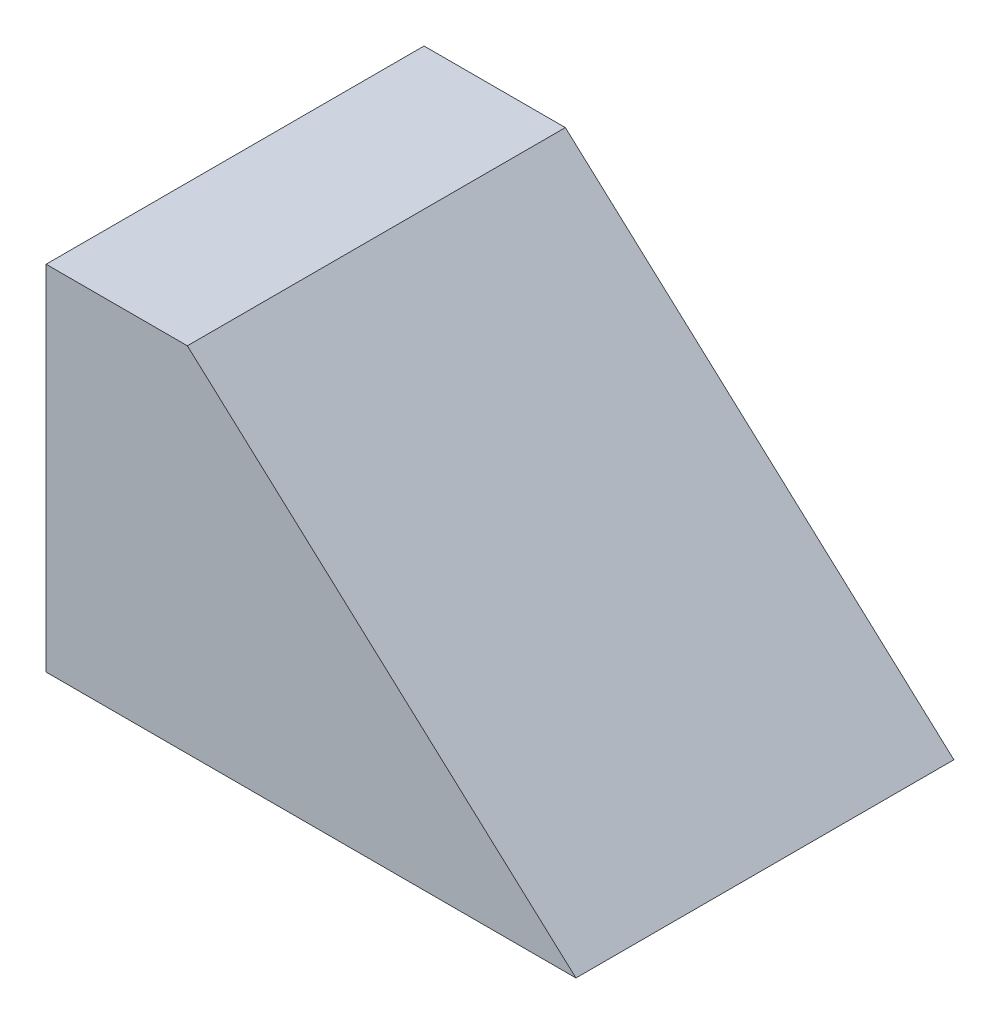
ISO-10303-21;
HEADER;
FILE_DESCRIPTION(('STEP AP214'),'2;1');
FILE_NAME('part.step','',(''),(''),'','','');
FILE_SCHEMA(('AUTOMOTIVE_DESIGN { 1 0 10303 214 1 1 1 1 }'));
ENDSEC;
DATA;
#1=APPLICATION_CONTEXT('core data for automotive mechanical design processes');
#2=APPLICATION_PROTOCOL_DEFINITION('international standard','automotive_design',2000,#1);
#3=PRODUCT_CONTEXT('',#1,'mechanical');
#4=PRODUCT('Part','Part','',(#3));
#5=PRODUCT_RELATED_PRODUCT_CATEGORY('part','',(#4));
#6=PRODUCT_DEFINITION_FORMATION('','',#4);
#7=PRODUCT_DEFINITION_CONTEXT('part definition',#1,'design');
#8=PRODUCT_DEFINITION('design','',#6,#7);
#9=PRODUCT_DEFINITION_SHAPE('','',#8);
#10=(LENGTH_UNIT() NAMED_UNIT(*) SI_UNIT(.MILLI.,.METRE.));
#11=(NAMED_UNIT(*) PLANE_ANGLE_UNIT() SI_UNIT($,.RADIAN.));
#12=(NAMED_UNIT(*) SI_UNIT($,.STERADIAN.) SOLID_ANGLE_UNIT());
#13=UNCERTAINTY_MEASURE_WITH_UNIT(LENGTH_MEASURE(1.E-05),#10,'distance_accuracy_value','');
#14=(GEOMETRIC_REPRESENTATION_CONTEXT(3) GLOBAL_UNCERTAINTY_ASSIGNED_CONTEXT((#13)) GLOBAL_UNIT_ASSIGNED_CONTEXT((#10,
#11,#12)) REPRESENTATION_CONTEXT('',''));
#15=CARTESIAN_POINT('',(0.,0.,0.));
#16=DIRECTION('',(0.,0.,1.));
#17=DIRECTION('',(1.,0.,0.));
#18=AXIS2_PLACEMENT_3D('',#15,#16,#17);
#19=CARTESIAN_POINT('',(0.,0.,107.));
#20=DIRECTION('',(1.,0.,0.));
#21=DIRECTION('',(0.,0.,-1.));
#22=AXIS2_PLACEMENT_3D('',#19,#20,#21);
#23=PLANE('',#22);
#24=DIRECTION('',(0.,-1.,0.));
#25=VECTOR('',#24,1.);
#26=CARTESIAN_POINT('',(0.,0.,0.));
#27=LINE('',#26,#25);
#28=CARTESIAN_POINT('',(0.,100.,0.));
#29=VERTEX_POINT('',#28);
#30=CARTESIAN_POINT('',(0.,0.,0.));
#31=VERTEX_POINT('',#30);
#32=EDGE_CURVE('E95',#29,#31,#27,.T.);
#33=ORIENTED_EDGE('',*,*,#32,.T.);
#34=DIRECTION('',(0.,0.,-1.));
#35=VECTOR('',#34,1.);
#36=CARTESIAN_POINT('',(0.,0.,107.));
#37=LINE('',#36,#35);
#38=CARTESIAN_POINT('',(0.,0.,107.));
#39=VERTEX_POINT('',#38);
#40=EDGE_CURVE('E11',#39,#31,#37,.T.);
#41=ORIENTED_EDGE('',*,*,#40,.F.);
#42=DIRECTION('',(0.,-1.,0.));
#43=VECTOR('',#42,1.);
#44=CARTESIAN_POINT('',(0.,0.,107.));
#45=LINE('',#44,#43);
#46=CARTESIAN_POINT('',(0.,100.,107.));
#47=VERTEX_POINT('',#46);
#48=EDGE_CURVE('E83',#47,#39,#45,.T.);
#49=ORIENTED_EDGE('',*,*,#48,.F.);
#50=DIRECTION('',(0.,0.,-1.));
#51=VECTOR('',#50,1.);
#52=CARTESIAN_POINT('',(0.,100.,107.));
#53=LINE('',#52,#51);
#54=EDGE_CURVE('E91',#47,#29,#53,.T.);
#55=ORIENTED_EDGE('',*,*,#54,.T.);
#56=EDGE_LOOP('',(#33,#41,#49,#55));
#57=FACE_BOUND('',#56,.T.);
#58=ADVANCED_FACE('F32',(#57),#23,.F.);
#59=CARTESIAN_POINT('',(0.,0.,107.));
#60=DIRECTION('',(0.,1.,0.));
#61=DIRECTION('',(0.,0.,1.));
#62=AXIS2_PLACEMENT_3D('',#59,#60,#61);
#63=PLANE('',#62);
#64=DIRECTION('',(1.,0.,0.));
#65=VECTOR('',#64,1.);
#66=CARTESIAN_POINT('',(0.,0.,0.));
#67=LINE('',#66,#65);
#68=CARTESIAN_POINT('',(150.,0.,0.));
#69=VERTEX_POINT('',#68);
#70=EDGE_CURVE('E87',#31,#69,#67,.T.);
#71=ORIENTED_EDGE('',*,*,#70,.T.);
#72=DIRECTION('',(0.,0.,-1.));
#73=VECTOR('',#72,1.);
#74=CARTESIAN_POINT('',(150.,0.,107.));
#75=LINE('',#74,#73);
#76=CARTESIAN_POINT('',(150.,0.,107.));
#77=VERTEX_POINT('',#76);
#78=EDGE_CURVE('E40',#77,#69,#75,.T.);
#79=ORIENTED_EDGE('',*,*,#78,.F.);
#80=DIRECTION('',(1.,0.,0.));
#81=VECTOR('',#80,1.);
#82=CARTESIAN_POINT('',(0.,0.,107.));
#83=LINE('',#82,#81);
#84=EDGE_CURVE('E78',#39,#77,#83,.T.);
#85=ORIENTED_EDGE('',*,*,#84,.F.);
#86=ORIENTED_EDGE('',*,*,#40,.T.);
#87=EDGE_LOOP('',(#71,#79,#85,#86));
#88=FACE_BOUND('',#87,.T.);
#89=ADVANCED_FACE('F86',(#88),#63,.F.);
#90=CARTESIAN_POINT('',(40.,100.,107.));
#91=DIRECTION('',(-0.672672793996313,-0.739940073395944,0.));
#92=DIRECTION('',(0.739940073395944,-0.672672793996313,0.));
#93=AXIS2_PLACEMENT_3D('',#90,#91,#92);
#94=PLANE('',#93);
#95=DIRECTION('',(-0.739940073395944,0.672672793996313,0.));
#96=VECTOR('',#95,1.);
#97=CARTESIAN_POINT('',(40.,100.,0.));
#98=LINE('',#97,#96);
#99=CARTESIAN_POINT('',(40.,100.,0.));
#100=VERTEX_POINT('',#99);
#101=EDGE_CURVE('E65',#69,#100,#98,.T.);
#102=ORIENTED_EDGE('',*,*,#101,.T.);
#103=DIRECTION('',(0.,0.,-1.));
#104=VECTOR('',#103,1.);
#105=CARTESIAN_POINT('',(40.,100.,107.));
#106=LINE('',#105,#104);
#107=CARTESIAN_POINT('',(40.,100.,107.));
#108=VERTEX_POINT('',#107);
#109=EDGE_CURVE('E88',#108,#100,#106,.T.);
#110=ORIENTED_EDGE('',*,*,#109,.F.);
#111=DIRECTION('',(-0.739940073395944,0.672672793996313,0.));
#112=VECTOR('',#111,1.);
#113=CARTESIAN_POINT('',(40.,100.,107.));
#114=LINE('',#113,#112);
#115=EDGE_CURVE('E81',#77,#108,#114,.T.);
#116=ORIENTED_EDGE('',*,*,#115,.F.);
#117=ORIENTED_EDGE('',*,*,#78,.T.);
#118=EDGE_LOOP('',(#102,#110,#116,#117));
#119=FACE_BOUND('',#118,.T.);
#120=ADVANCED_FACE('F89',(#119),#94,.F.);
#121=CARTESIAN_POINT('',(0.,100.,107.));
#122=DIRECTION('',(0.,-1.,0.));
#123=DIRECTION('',(0.,0.,-1.));
#124=AXIS2_PLACEMENT_3D('',#121,#122,#123);
#125=PLANE('',#124);
#126=DIRECTION('',(-1.,0.,0.));
#127=VECTOR('',#126,1.);
#128=CARTESIAN_POINT('',(0.,100.,0.));
#129=LINE('',#128,#127);
#130=EDGE_CURVE('E71',#100,#29,#129,.T.);
#131=ORIENTED_EDGE('',*,*,#130,.T.);
#132=ORIENTED_EDGE('',*,*,#54,.F.);
#133=DIRECTION('',(-1.,0.,0.));
#134=VECTOR('',#133,1.);
#135=CARTESIAN_POINT('',(0.,100.,107.));
#136=LINE('',#135,#134);
#137=EDGE_CURVE('E48',#108,#47,#136,.T.);
#138=ORIENTED_EDGE('',*,*,#137,.F.);
#139=ORIENTED_EDGE('',*,*,#109,.T.);
#140=EDGE_LOOP('',(#131,#132,#138,#139));
#141=FACE_BOUND('',#140,.T.);
#142=ADVANCED_FACE('F102',(#141),#125,.F.);
#143=CARTESIAN_POINT('',(0.,0.,107.));
#144=DIRECTION('',(0.,0.,-1.));
#145=DIRECTION('',(-1.,0.,0.));
#146=AXIS2_PLACEMENT_3D('',#143,#144,#145);
#147=PLANE('',#146);
#148=ORIENTED_EDGE('',*,*,#48,.T.);
#149=ORIENTED_EDGE('',*,*,#84,.T.);
#150=ORIENTED_EDGE('',*,*,#115,.T.);
#151=ORIENTED_EDGE('',*,*,#137,.T.);
#152=EDGE_LOOP('',(#148,#149,#150,#151));
#153=FACE_BOUND('',#152,.T.);
#154=ADVANCED_FACE('F79',(#153),#147,.F.);
#155=CARTESIAN_POINT('',(0.,0.,0.));
#156=DIRECTION('',(0.,0.,-1.));
#157=DIRECTION('',(-1.,0.,0.));
#158=AXIS2_PLACEMENT_3D('',#155,#156,#157);
#159=PLANE('',#158);
#160=ORIENTED_EDGE('',*,*,#32,.F.);
#161=ORIENTED_EDGE('',*,*,#130,.F.);
#162=ORIENTED_EDGE('',*,*,#101,.F.);
#163=ORIENTED_EDGE('',*,*,#70,.F.);
#164=EDGE_LOOP('',(#160,#161,#162,#163));
#165=FACE_BOUND('',#164,.T.);
#166=ADVANCED_FACE('F105',(#165),#159,.T.);
#167=CLOSED_SHELL('',(#58,#89,#120,#142,#154,#166));
#168=MANIFOLD_SOLID_BREP('B2',#167);
#169=ADVANCED_BREP_SHAPE_REPRESENTATION('',(#18,#168),#14);
#170=SHAPE_DEFINITION_REPRESENTATION(#9,#169);
ENDSEC;
END-ISO-10303-21;
